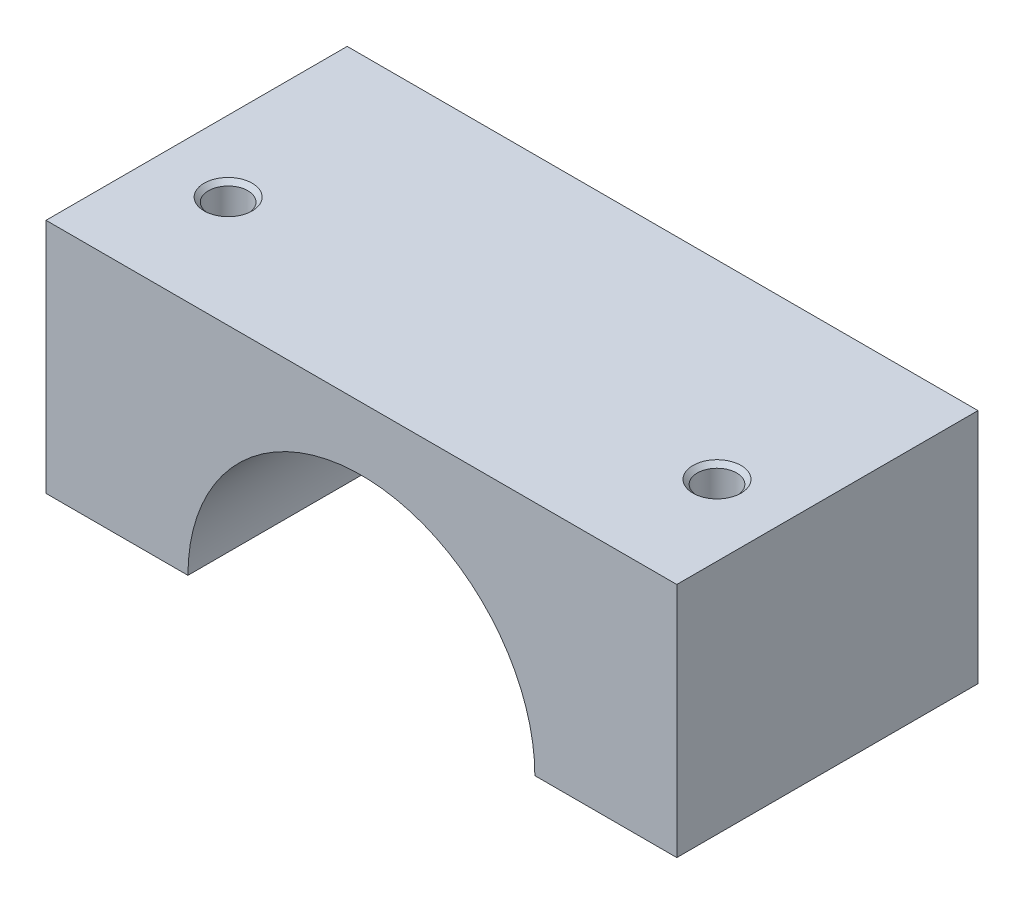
from build123d import *

# Parameters (mm, degrees)
EXTRUDE_1_DEPTH              = 19.1
HOLE_WIZARD_M3_1_D           = 2.5
HOLE_WIZARD_M3_1_DEPTH       = 26.748924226
HOLE_WIZARD_M3_1_CSINK_D     = 3.05
HOLE_WIZARD_M3_1_CSINK_ANGLE = 90
HOLE_WIZARD_M3_1_TIP         = 0.751075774


with BuildPart() as part:
    # Sketch 1 → Extrude 1 (new body)
    with BuildSketch(Plane.XY):
        with BuildLine():
            Line((-11, 0), (-20, 0))
            Line((-20, 0), (-20, 15))
            Line((-20, 15), (20, 15))
            Line((20, 15), (20, 0))
            Line((20, 0), (11, 0))
            ThreePointArc((11, 0), (0, 11), (-11, 0))
        make_face()
    extrude(amount=EXTRUDE_1_DEPTH)

    # Hole Wizard M3 _1
    with Locations(Plane(origin=(0, 15, 0), x_dir=(1, 0, 0), z_dir=(0, 1, 0))):
        with Locations((-15.5, -12.05), (15.5, -12.05)):
            CounterSinkHole(HOLE_WIZARD_M3_1_D / 2, HOLE_WIZARD_M3_1_CSINK_D / 2, depth=HOLE_WIZARD_M3_1_DEPTH, counter_sink_angle=HOLE_WIZARD_M3_1_CSINK_ANGLE)
            with Locations((0, 0, -(HOLE_WIZARD_M3_1_DEPTH + HOLE_WIZARD_M3_1_TIP / 2))):  # 118° drill point
                Cone(0, HOLE_WIZARD_M3_1_D / 2, HOLE_WIZARD_M3_1_TIP, mode=Mode.SUBTRACT)


solid = part.part
